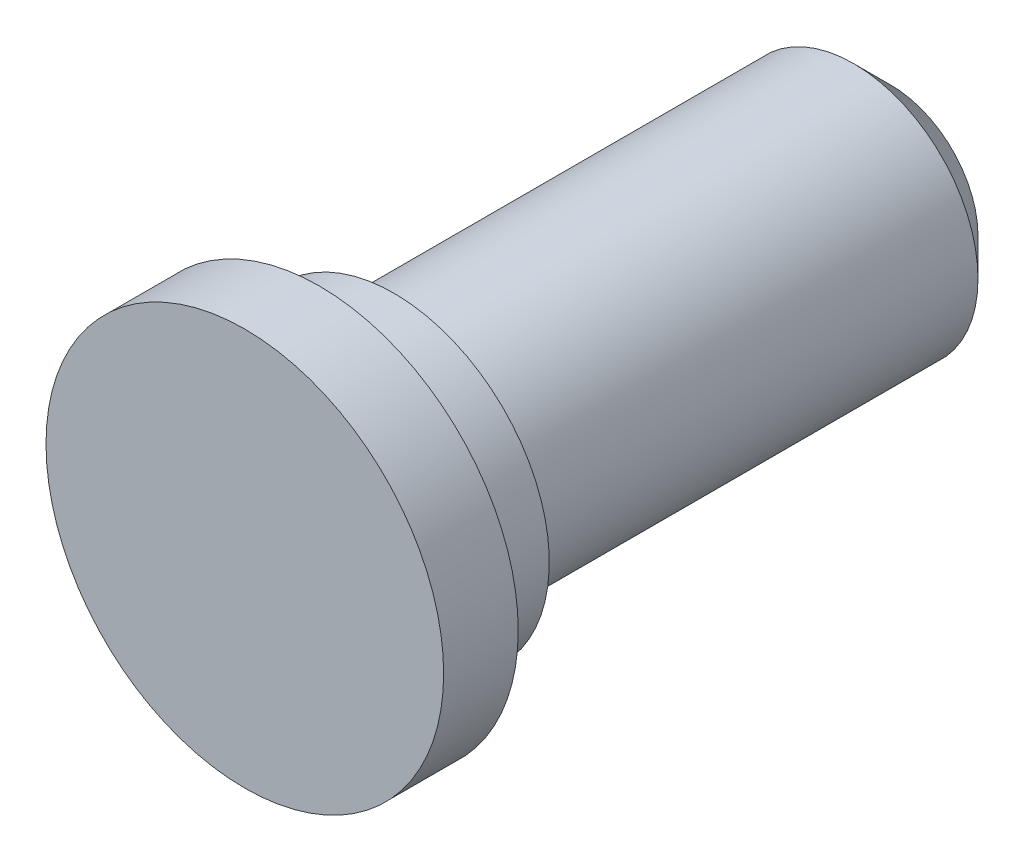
ISO-10303-21;
HEADER;
FILE_DESCRIPTION(('STEP AP214'),'2;1');
FILE_NAME('part.step','',(''),(''),'','','');
FILE_SCHEMA(('AUTOMOTIVE_DESIGN { 1 0 10303 214 1 1 1 1 }'));
ENDSEC;
DATA;
#1=APPLICATION_CONTEXT('core data for automotive mechanical design processes');
#2=APPLICATION_PROTOCOL_DEFINITION('international standard','automotive_design',2000,#1);
#3=PRODUCT_CONTEXT('',#1,'mechanical');
#4=PRODUCT('Part','Part','',(#3));
#5=PRODUCT_RELATED_PRODUCT_CATEGORY('part','',(#4));
#6=PRODUCT_DEFINITION_FORMATION('','',#4);
#7=PRODUCT_DEFINITION_CONTEXT('part definition',#1,'design');
#8=PRODUCT_DEFINITION('design','',#6,#7);
#9=PRODUCT_DEFINITION_SHAPE('','',#8);
#10=(LENGTH_UNIT() NAMED_UNIT(*) SI_UNIT(.MILLI.,.METRE.));
#11=(NAMED_UNIT(*) PLANE_ANGLE_UNIT() SI_UNIT($,.RADIAN.));
#12=(NAMED_UNIT(*) SI_UNIT($,.STERADIAN.) SOLID_ANGLE_UNIT());
#13=UNCERTAINTY_MEASURE_WITH_UNIT(LENGTH_MEASURE(1.E-05),#10,'distance_accuracy_value','');
#14=(GEOMETRIC_REPRESENTATION_CONTEXT(3) GLOBAL_UNCERTAINTY_ASSIGNED_CONTEXT((#13)) GLOBAL_UNIT_ASSIGNED_CONTEXT((#10,
#11,#12)) REPRESENTATION_CONTEXT('',''));
#15=CARTESIAN_POINT('',(0.,0.,0.));
#16=DIRECTION('',(0.,0.,1.));
#17=DIRECTION('',(1.,0.,0.));
#18=AXIS2_PLACEMENT_3D('',#15,#16,#17);
#19=CARTESIAN_POINT('',(4.9999999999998,0.,-23.));
#20=DIRECTION('',(0.,0.,1.));
#21=DIRECTION('',(-1.,0.,0.));
#22=AXIS2_PLACEMENT_3D('',#19,#20,#21);
#23=PLANE('',#22);
#24=CARTESIAN_POINT('',(0.,0.,-23.));
#25=DIRECTION('',(0.,0.,1.));
#26=DIRECTION('',(1.,0.,0.));
#27=AXIS2_PLACEMENT_3D('',#24,#25,#26);
#28=CIRCLE('',#27,3.49999999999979);
#29=CARTESIAN_POINT('',(3.49999999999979,0.,-23.));
#30=VERTEX_POINT('',#29);
#31=EDGE_CURVE('E8',#30,#30,#28,.F.);
#32=ORIENTED_EDGE('',*,*,#31,.T.);
#33=EDGE_LOOP('',(#32));
#34=FACE_BOUND('',#33,.T.);
#35=ADVANCED_FACE('F12',(#34),#23,.F.);
#36=CARTESIAN_POINT('',(0.,0.,8.));
#37=DIRECTION('',(0.,0.,1.));
#38=DIRECTION('',(-1.,0.,0.));
#39=AXIS2_PLACEMENT_3D('',#36,#37,#38);
#40=CYLINDRICAL_SURFACE('',#39,4.99999999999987);
#41=CARTESIAN_POINT('',(0.,0.,-21.5));
#42=DIRECTION('',(0.,0.,1.));
#43=DIRECTION('',(1.,0.,0.));
#44=AXIS2_PLACEMENT_3D('',#41,#42,#43);
#45=CIRCLE('',#44,4.99999999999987);
#46=CARTESIAN_POINT('',(4.99999999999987,0.,-21.5));
#47=VERTEX_POINT('',#46);
#48=EDGE_CURVE('E19',#47,#47,#45,.T.);
#49=ORIENTED_EDGE('',*,*,#48,.T.);
#50=EDGE_LOOP('',(#49));
#51=FACE_BOUND('',#50,.T.);
#52=CARTESIAN_POINT('',(0.,0.,-3.));
#53=DIRECTION('',(0.,0.,1.));
#54=DIRECTION('',(-1.,0.,0.));
#55=AXIS2_PLACEMENT_3D('',#52,#53,#54);
#56=CIRCLE('',#55,4.99999999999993);
#57=CARTESIAN_POINT('',(-4.99999999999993,0.,-3.));
#58=VERTEX_POINT('',#57);
#59=EDGE_CURVE('E23',#58,#58,#56,.T.);
#60=ORIENTED_EDGE('',*,*,#59,.F.);
#61=EDGE_LOOP('',(#60));
#62=FACE_BOUND('',#61,.T.);
#63=ADVANCED_FACE('F65',(#51,#62),#40,.T.);
#64=CARTESIAN_POINT('',(6.25000000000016,0.,-3.00000000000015));
#65=DIRECTION('',(0.,0.,1.));
#66=DIRECTION('',(-1.,0.,0.));
#67=AXIS2_PLACEMENT_3D('',#64,#65,#66);
#68=PLANE('',#67);
#69=CARTESIAN_POINT('',(0.,0.,-3.00000000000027));
#70=DIRECTION('',(0.,0.,1.));
#71=DIRECTION('',(-1.,0.,0.));
#72=AXIS2_PLACEMENT_3D('',#69,#70,#71);
#73=CIRCLE('',#72,6.25000000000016);
#74=CARTESIAN_POINT('',(-6.25000000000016,0.,-3.00000000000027));
#75=VERTEX_POINT('',#74);
#76=EDGE_CURVE('E27',#75,#75,#73,.T.);
#77=ORIENTED_EDGE('',*,*,#76,.F.);
#78=EDGE_LOOP('',(#77));
#79=FACE_BOUND('',#78,.T.);
#80=ORIENTED_EDGE('',*,*,#59,.T.);
#81=EDGE_LOOP('',(#80));
#82=FACE_BOUND('',#81,.T.);
#83=ADVANCED_FACE('F59',(#79,#82),#68,.F.);
#84=CARTESIAN_POINT('',(0.,0.,8.));
#85=DIRECTION('',(0.,0.,1.));
#86=DIRECTION('',(-1.,0.,0.));
#87=AXIS2_PLACEMENT_3D('',#84,#85,#86);
#88=CYLINDRICAL_SURFACE('',#87,6.25000000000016);
#89=CARTESIAN_POINT('',(0.,0.,0.));
#90=DIRECTION('',(0.,0.,1.));
#91=DIRECTION('',(-1.,0.,0.));
#92=AXIS2_PLACEMENT_3D('',#89,#90,#91);
#93=CIRCLE('',#92,6.25000000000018);
#94=CARTESIAN_POINT('',(-6.25000000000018,0.,0.));
#95=VERTEX_POINT('',#94);
#96=EDGE_CURVE('E32',#95,#95,#93,.T.);
#97=ORIENTED_EDGE('',*,*,#96,.F.);
#98=EDGE_LOOP('',(#97));
#99=FACE_BOUND('',#98,.T.);
#100=ORIENTED_EDGE('',*,*,#76,.T.);
#101=EDGE_LOOP('',(#100));
#102=FACE_BOUND('',#101,.T.);
#103=ADVANCED_FACE('F53',(#99,#102),#88,.T.);
#104=CARTESIAN_POINT('',(6.25000000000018,0.,0.));
#105=DIRECTION('',(0.,0.,1.));
#106=DIRECTION('',(-1.,0.,0.));
#107=AXIS2_PLACEMENT_3D('',#104,#105,#106);
#108=PLANE('',#107);
#109=CARTESIAN_POINT('',(0.,0.,0.));
#110=DIRECTION('',(0.,0.,1.));
#111=DIRECTION('',(-1.,0.,0.));
#112=AXIS2_PLACEMENT_3D('',#109,#110,#111);
#113=CIRCLE('',#112,8.);
#114=CARTESIAN_POINT('',(-8.,0.,0.));
#115=VERTEX_POINT('',#114);
#116=EDGE_CURVE('E35',#115,#115,#113,.T.);
#117=ORIENTED_EDGE('',*,*,#116,.F.);
#118=EDGE_LOOP('',(#117));
#119=FACE_BOUND('',#118,.T.);
#120=ORIENTED_EDGE('',*,*,#96,.T.);
#121=EDGE_LOOP('',(#120));
#122=FACE_BOUND('',#121,.T.);
#123=ADVANCED_FACE('F47',(#119,#122),#108,.F.);
#124=CARTESIAN_POINT('',(0.,0.,8.));
#125=DIRECTION('',(0.,0.,1.));
#126=DIRECTION('',(-1.,0.,0.));
#127=AXIS2_PLACEMENT_3D('',#124,#125,#126);
#128=CYLINDRICAL_SURFACE('',#127,8.);
#129=CARTESIAN_POINT('',(0.,0.,3.00000000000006));
#130=DIRECTION('',(0.,0.,1.));
#131=DIRECTION('',(-1.,0.,0.));
#132=AXIS2_PLACEMENT_3D('',#129,#130,#131);
#133=CIRCLE('',#132,8.);
#134=CARTESIAN_POINT('',(-8.,0.,3.00000000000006));
#135=VERTEX_POINT('',#134);
#136=EDGE_CURVE('E38',#135,#135,#133,.T.);
#137=ORIENTED_EDGE('',*,*,#136,.F.);
#138=EDGE_LOOP('',(#137));
#139=FACE_BOUND('',#138,.T.);
#140=ORIENTED_EDGE('',*,*,#116,.T.);
#141=EDGE_LOOP('',(#140));
#142=FACE_BOUND('',#141,.T.);
#143=ADVANCED_FACE('F44',(#139,#142),#128,.T.);
#144=CARTESIAN_POINT('',(0.,0.,3.00000000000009));
#145=DIRECTION('',(0.,0.,-1.));
#146=DIRECTION('',(1.,0.,0.));
#147=AXIS2_PLACEMENT_3D('',#144,#145,#146);
#148=PLANE('',#147);
#149=ORIENTED_EDGE('',*,*,#136,.T.);
#150=EDGE_LOOP('',(#149));
#151=FACE_BOUND('',#150,.T.);
#152=ADVANCED_FACE('F42',(#151),#148,.F.);
#153=CARTESIAN_POINT('',(0.,0.,-21.5));
#154=DIRECTION('',(0.,0.,1.));
#155=DIRECTION('',(1.,0.,0.));
#156=AXIS2_PLACEMENT_3D('',#153,#154,#155);
#157=CONICAL_SURFACE('',#156,4.99999999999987,0.785398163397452);
#158=ORIENTED_EDGE('',*,*,#31,.F.);
#159=EDGE_LOOP('',(#158));
#160=FACE_BOUND('',#159,.T.);
#161=ORIENTED_EDGE('',*,*,#48,.F.);
#162=EDGE_LOOP('',(#161));
#163=FACE_BOUND('',#162,.T.);
#164=ADVANCED_FACE('F14',(#160,#163),#157,.T.);
#165=CLOSED_SHELL('',(#35,#63,#83,#103,#123,#143,#152,#164));
#166=MANIFOLD_SOLID_BREP('B1',#165);
#167=ADVANCED_BREP_SHAPE_REPRESENTATION('',(#18,#166),#14);
#168=SHAPE_DEFINITION_REPRESENTATION(#9,#167);
ENDSEC;
END-ISO-10303-21;
